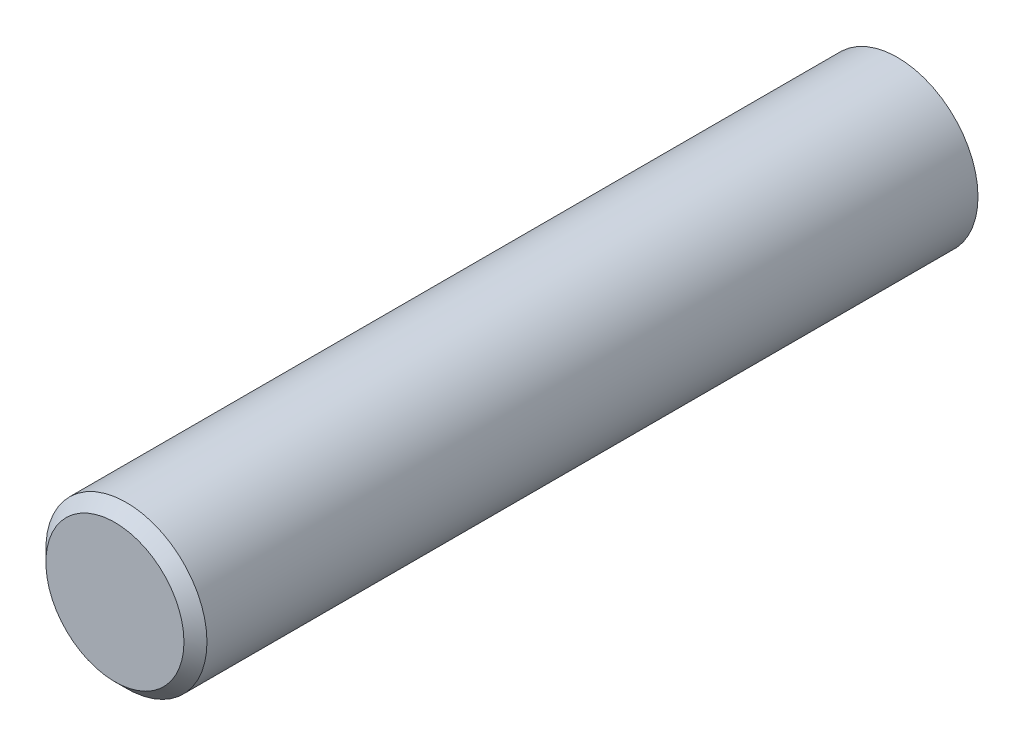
from build123d import *

# Parameters (mm, degrees)
ESQUISSE1_R        = 3.5
BOSS_EXTRU_1_DEPTH = 34
CHANFREIN1_SIZE    = 0.5


with BuildPart() as part:
    # Esquisse1 → Boss.-Extru.1 (new body)
    with BuildSketch(Plane.XY):
        Circle(ESQUISSE1_R)
    extrude(amount=BOSS_EXTRU_1_DEPTH)

    # Chanfrein1
    chanfrein1_edges = [part.edges().sort_by_distance(p)[0] for p in [
        (-3.5, 0, 34),
    ]]
    chamfer(chanfrein1_edges, length=CHANFREIN1_SIZE)


solid = part.part
